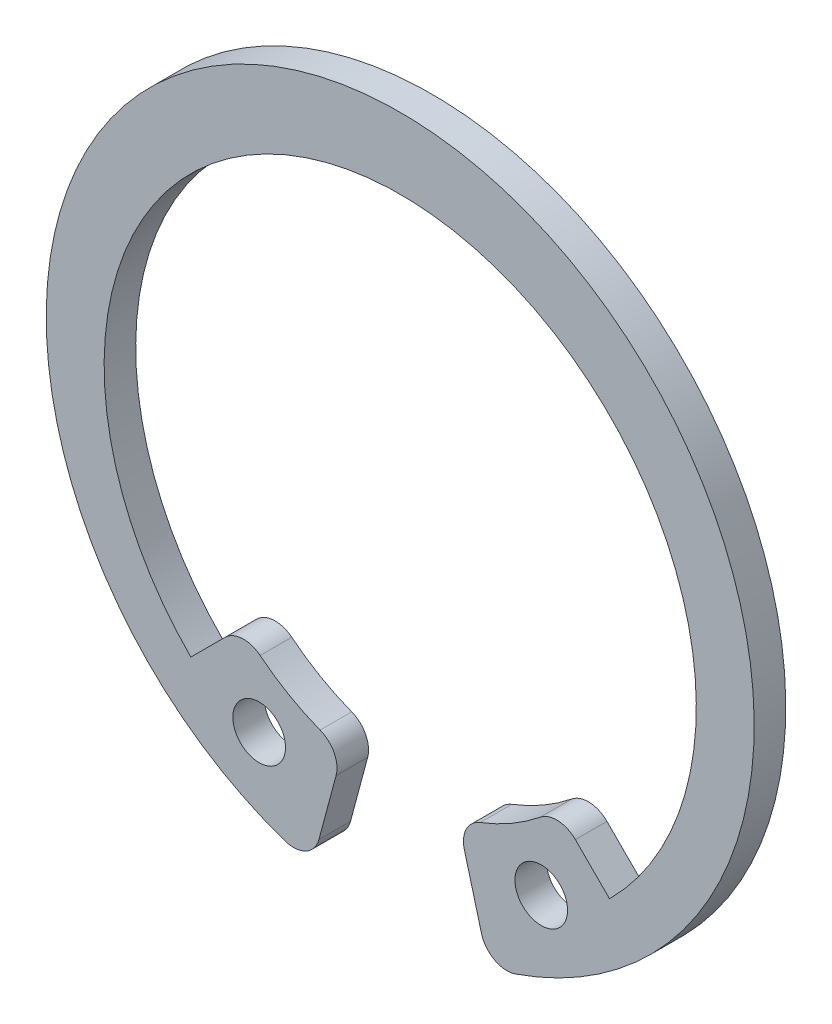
ISO-10303-21;
HEADER;
FILE_DESCRIPTION(('STEP AP214'),'2;1');
FILE_NAME('part.step','',(''),(''),'','','');
FILE_SCHEMA(('AUTOMOTIVE_DESIGN { 1 0 10303 214 1 1 1 1 }'));
ENDSEC;
DATA;
#1=APPLICATION_CONTEXT('core data for automotive mechanical design processes');
#2=APPLICATION_PROTOCOL_DEFINITION('international standard','automotive_design',2000,#1);
#3=PRODUCT_CONTEXT('',#1,'mechanical');
#4=PRODUCT('Part','Part','',(#3));
#5=PRODUCT_RELATED_PRODUCT_CATEGORY('part','',(#4));
#6=PRODUCT_DEFINITION_FORMATION('','',#4);
#7=PRODUCT_DEFINITION_CONTEXT('part definition',#1,'design');
#8=PRODUCT_DEFINITION('design','',#6,#7);
#9=PRODUCT_DEFINITION_SHAPE('','',#8);
#10=(LENGTH_UNIT() NAMED_UNIT(*) SI_UNIT(.MILLI.,.METRE.));
#11=(NAMED_UNIT(*) PLANE_ANGLE_UNIT() SI_UNIT($,.RADIAN.));
#12=(NAMED_UNIT(*) SI_UNIT($,.STERADIAN.) SOLID_ANGLE_UNIT());
#13=UNCERTAINTY_MEASURE_WITH_UNIT(LENGTH_MEASURE(1.E-05),#10,'distance_accuracy_value','');
#14=(GEOMETRIC_REPRESENTATION_CONTEXT(3) GLOBAL_UNCERTAINTY_ASSIGNED_CONTEXT((#13)) GLOBAL_UNIT_ASSIGNED_CONTEXT((#10,
#11,#12)) REPRESENTATION_CONTEXT('',''));
#15=CARTESIAN_POINT('',(0.,0.,0.));
#16=DIRECTION('',(0.,0.,1.));
#17=DIRECTION('',(1.,0.,0.));
#18=AXIS2_PLACEMENT_3D('',#15,#16,#17);
#19=CARTESIAN_POINT('',(5.94920615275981,-7.36341971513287,1.20000000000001));
#20=DIRECTION('',(0.,0.,-1.));
#21=DIRECTION('',(-1.,0.,0.));
#22=AXIS2_PLACEMENT_3D('',#19,#20,#21);
#23=PLANE('',#22);
#24=CARTESIAN_POINT('',(-5.35892287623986,-9.13310690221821,1.20000000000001));
#25=DIRECTION('',(0.,0.,1.));
#26=DIRECTION('',(1.,0.,0.));
#27=AXIS2_PLACEMENT_3D('',#24,#25,#26);
#28=CIRCLE('',#27,1.);
#29=CARTESIAN_POINT('',(-4.35892287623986,-9.13310690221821,1.20000000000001));
#30=VERTEX_POINT('',#29);
#31=EDGE_CURVE('E146',#30,#30,#28,.T.);
#32=ORIENTED_EDGE('',*,*,#31,.F.);
#33=EDGE_LOOP('',(#32));
#34=FACE_BOUND('',#33,.T.);
#35=CARTESIAN_POINT('',(5.94920615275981,-7.36341971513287,1.20000000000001));
#36=DIRECTION('',(0.,0.,1.));
#37=DIRECTION('',(-1.,0.,0.));
#38=AXIS2_PLACEMENT_3D('',#35,#36,#37);
#39=CIRCLE('',#38,1.);
#40=CARTESIAN_POINT('',(6.65631293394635,-6.65631293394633,1.20000000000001));
#41=VERTEX_POINT('',#40);
#42=CARTESIAN_POINT('',(5.32075214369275,-6.585572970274,1.20000000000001));
#43=VERTEX_POINT('',#42);
#44=EDGE_CURVE('E176',#41,#43,#39,.T.);
#45=ORIENTED_EDGE('',*,*,#44,.T.);
#46=CARTESIAN_POINT('',(0.,0.,1.20000000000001));
#47=DIRECTION('',(0.,0.,-1.));
#48=DIRECTION('',(1.,0.,0.));
#49=AXIS2_PLACEMENT_3D('',#46,#47,#48);
#50=CIRCLE('',#49,8.46641451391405);
#51=CARTESIAN_POINT('',(3.04289741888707,-7.90069300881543,1.20000000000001));
#52=VERTEX_POINT('',#51);
#53=EDGE_CURVE('E141',#43,#52,#50,.T.);
#54=ORIENTED_EDGE('',*,*,#53,.T.);
#55=CARTESIAN_POINT('',(3.40230545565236,-8.83387351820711,1.20000000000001));
#56=DIRECTION('',(0.,0.,1.));
#57=DIRECTION('',(-1.,0.,0.));
#58=AXIS2_PLACEMENT_3D('',#55,#56,#57);
#59=CIRCLE('',#58,1.);
#60=CARTESIAN_POINT('',(2.43637962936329,-9.09269256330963,1.20000000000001));
#61=VERTEX_POINT('',#60);
#62=EDGE_CURVE('E179',#52,#61,#59,.T.);
#63=ORIENTED_EDGE('',*,*,#62,.T.);
#64=DIRECTION('',(0.258819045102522,-0.965925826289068,0.));
#65=VECTOR('',#64,1.);
#66=CARTESIAN_POINT('',(3.08940929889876,-11.5298324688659,1.20000000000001));
#67=LINE('',#66,#65);
#68=CARTESIAN_POINT('',(3.08940929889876,-11.5298324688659,1.20000000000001));
#69=VERTEX_POINT('',#68);
#70=EDGE_CURVE('E181',#61,#69,#67,.T.);
#71=ORIENTED_EDGE('',*,*,#70,.T.);
#72=CARTESIAN_POINT('',(4.05533512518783,-11.2710134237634,1.20000000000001));
#73=DIRECTION('',(0.,0.,1.));
#74=DIRECTION('',(-1.,0.,0.));
#75=AXIS2_PLACEMENT_3D('',#72,#73,#74);
#76=CIRCLE('',#75,1.);
#77=CARTESIAN_POINT('',(4.38106485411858,-12.2164763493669,1.20000000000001));
#78=VERTEX_POINT('',#77);
#79=EDGE_CURVE('E183',#69,#78,#76,.T.);
#80=ORIENTED_EDGE('',*,*,#79,.T.);
#81=CARTESIAN_POINT('',(0.,0.5,1.20000000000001));
#82=DIRECTION('',(0.,0.,1.));
#83=DIRECTION('',(1.,0.,0.));
#84=AXIS2_PLACEMENT_3D('',#81,#82,#83);
#85=CIRCLE('',#84,13.45);
#86=CARTESIAN_POINT('',(-4.38106485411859,-12.2164763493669,1.20000000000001));
#87=VERTEX_POINT('',#86);
#88=EDGE_CURVE('E185',#78,#87,#85,.T.);
#89=ORIENTED_EDGE('',*,*,#88,.T.);
#90=CARTESIAN_POINT('',(-4.05533512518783,-11.2710134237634,1.20000000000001));
#91=DIRECTION('',(0.,0.,1.));
#92=DIRECTION('',(1.,0.,0.));
#93=AXIS2_PLACEMENT_3D('',#90,#91,#92);
#94=CIRCLE('',#93,1.);
#95=CARTESIAN_POINT('',(-3.08940929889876,-11.5298324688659,1.20000000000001));
#96=VERTEX_POINT('',#95);
#97=EDGE_CURVE('E187',#87,#96,#94,.T.);
#98=ORIENTED_EDGE('',*,*,#97,.T.);
#99=DIRECTION('',(0.258819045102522,0.965925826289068,0.));
#100=VECTOR('',#99,1.);
#101=CARTESIAN_POINT('',(-3.08940929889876,-11.5298324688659,1.20000000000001));
#102=LINE('',#101,#100);
#103=CARTESIAN_POINT('',(-2.43637962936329,-9.09269256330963,1.20000000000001));
#104=VERTEX_POINT('',#103);
#105=EDGE_CURVE('E189',#96,#104,#102,.T.);
#106=ORIENTED_EDGE('',*,*,#105,.T.);
#107=CARTESIAN_POINT('',(-3.40230545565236,-8.83387351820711,1.20000000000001));
#108=DIRECTION('',(0.,0.,1.));
#109=DIRECTION('',(1.,0.,0.));
#110=AXIS2_PLACEMENT_3D('',#107,#108,#109);
#111=CIRCLE('',#110,1.);
#112=CARTESIAN_POINT('',(-3.04289741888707,-7.90069300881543,1.20000000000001));
#113=VERTEX_POINT('',#112);
#114=EDGE_CURVE('E191',#104,#113,#111,.T.);
#115=ORIENTED_EDGE('',*,*,#114,.T.);
#116=CARTESIAN_POINT('',(0.,0.,1.20000000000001));
#117=DIRECTION('',(0.,0.,-1.));
#118=DIRECTION('',(1.,0.,0.));
#119=AXIS2_PLACEMENT_3D('',#116,#117,#118);
#120=CIRCLE('',#119,8.46641451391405);
#121=CARTESIAN_POINT('',(-5.32075214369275,-6.585572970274,1.20000000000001));
#122=VERTEX_POINT('',#121);
#123=EDGE_CURVE('E193',#113,#122,#120,.T.);
#124=ORIENTED_EDGE('',*,*,#123,.T.);
#125=CARTESIAN_POINT('',(-5.94920615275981,-7.36341971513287,1.20000000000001));
#126=DIRECTION('',(0.,0.,1.));
#127=DIRECTION('',(-1.,0.,0.));
#128=AXIS2_PLACEMENT_3D('',#125,#126,#127);
#129=CIRCLE('',#128,1.);
#130=CARTESIAN_POINT('',(-6.65631293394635,-6.65631293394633,1.20000000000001));
#131=VERTEX_POINT('',#130);
#132=EDGE_CURVE('E195',#122,#131,#129,.T.);
#133=ORIENTED_EDGE('',*,*,#132,.T.);
#134=DIRECTION('',(-0.707106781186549,-0.707106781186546,0.));
#135=VECTOR('',#134,1.);
#136=CARTESIAN_POINT('',(-6.65631293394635,-6.65631293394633,1.20000000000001));
#137=LINE('',#136,#135);
#138=CARTESIAN_POINT('',(-7.95495128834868,-7.95495128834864,1.20000000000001));
#139=VERTEX_POINT('',#138);
#140=EDGE_CURVE('E197',#131,#139,#137,.T.);
#141=ORIENTED_EDGE('',*,*,#140,.T.);
#142=CARTESIAN_POINT('',(0.,0.,1.20000000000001));
#143=DIRECTION('',(0.,0.,-1.));
#144=DIRECTION('',(1.,0.,0.));
#145=AXIS2_PLACEMENT_3D('',#142,#143,#144);
#146=CIRCLE('',#145,11.25);
#147=CARTESIAN_POINT('',(7.95495128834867,-7.95495128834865,1.20000000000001));
#148=VERTEX_POINT('',#147);
#149=EDGE_CURVE('E46',#139,#148,#146,.T.);
#150=ORIENTED_EDGE('',*,*,#149,.T.);
#151=DIRECTION('',(-0.707106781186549,0.707106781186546,0.));
#152=VECTOR('',#151,1.);
#153=CARTESIAN_POINT('',(6.65631293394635,-6.65631293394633,1.20000000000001));
#154=LINE('',#153,#152);
#155=EDGE_CURVE('E41',#148,#41,#154,.T.);
#156=ORIENTED_EDGE('',*,*,#155,.T.);
#157=EDGE_LOOP('',(#45,#54,#63,#71,#80,#89,#98,#106,#115,#124,#133,#141,#150,#156));
#158=FACE_BOUND('',#157,.T.);
#159=CARTESIAN_POINT('',(5.35892287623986,-9.13310690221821,1.20000000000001));
#160=DIRECTION('',(0.,0.,1.));
#161=DIRECTION('',(-1.,0.,0.));
#162=AXIS2_PLACEMENT_3D('',#159,#160,#161);
#163=CIRCLE('',#162,1.);
#164=CARTESIAN_POINT('',(4.35892287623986,-9.13310690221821,1.20000000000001));
#165=VERTEX_POINT('',#164);
#166=EDGE_CURVE('E316',#165,#165,#163,.T.);
#167=ORIENTED_EDGE('',*,*,#166,.F.);
#168=EDGE_LOOP('',(#167));
#169=FACE_BOUND('',#168,.T.);
#170=ADVANCED_FACE('F26',(#34,#158,#169),#23,.F.);
#171=CARTESIAN_POINT('',(5.94920615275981,-7.36341971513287,0.));
#172=DIRECTION('',(0.,0.,-1.));
#173=DIRECTION('',(-1.,0.,0.));
#174=AXIS2_PLACEMENT_3D('',#171,#172,#173);
#175=PLANE('',#174);
#176=CARTESIAN_POINT('',(-5.35892287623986,-9.13310690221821,0.));
#177=DIRECTION('',(0.,0.,1.));
#178=DIRECTION('',(1.,0.,0.));
#179=AXIS2_PLACEMENT_3D('',#176,#177,#178);
#180=CIRCLE('',#179,1.);
#181=CARTESIAN_POINT('',(-4.35892287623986,-9.13310690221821,0.));
#182=VERTEX_POINT('',#181);
#183=EDGE_CURVE('E149',#182,#182,#180,.T.);
#184=ORIENTED_EDGE('',*,*,#183,.T.);
#185=EDGE_LOOP('',(#184));
#186=FACE_BOUND('',#185,.T.);
#187=CARTESIAN_POINT('',(5.94920615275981,-7.36341971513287,0.));
#188=DIRECTION('',(0.,0.,1.));
#189=DIRECTION('',(-1.,0.,0.));
#190=AXIS2_PLACEMENT_3D('',#187,#188,#189);
#191=CIRCLE('',#190,1.);
#192=CARTESIAN_POINT('',(6.65631293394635,-6.65631293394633,0.));
#193=VERTEX_POINT('',#192);
#194=CARTESIAN_POINT('',(5.32075214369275,-6.585572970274,0.));
#195=VERTEX_POINT('',#194);
#196=EDGE_CURVE('E132',#193,#195,#191,.T.);
#197=ORIENTED_EDGE('',*,*,#196,.F.);
#198=DIRECTION('',(-0.707106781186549,0.707106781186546,0.));
#199=VECTOR('',#198,1.);
#200=CARTESIAN_POINT('',(6.65631293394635,-6.65631293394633,0.));
#201=LINE('',#200,#199);
#202=CARTESIAN_POINT('',(7.95495128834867,-7.95495128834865,0.));
#203=VERTEX_POINT('',#202);
#204=EDGE_CURVE('E174',#203,#193,#201,.T.);
#205=ORIENTED_EDGE('',*,*,#204,.F.);
#206=CARTESIAN_POINT('',(0.,0.,0.));
#207=DIRECTION('',(0.,0.,-1.));
#208=DIRECTION('',(1.,0.,0.));
#209=AXIS2_PLACEMENT_3D('',#206,#207,#208);
#210=CIRCLE('',#209,11.25);
#211=CARTESIAN_POINT('',(-7.95495128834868,-7.95495128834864,0.));
#212=VERTEX_POINT('',#211);
#213=EDGE_CURVE('E172',#212,#203,#210,.T.);
#214=ORIENTED_EDGE('',*,*,#213,.F.);
#215=DIRECTION('',(-0.707106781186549,-0.707106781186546,0.));
#216=VECTOR('',#215,1.);
#217=CARTESIAN_POINT('',(-6.65631293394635,-6.65631293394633,0.));
#218=LINE('',#217,#216);
#219=CARTESIAN_POINT('',(-6.65631293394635,-6.65631293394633,0.));
#220=VERTEX_POINT('',#219);
#221=EDGE_CURVE('E170',#220,#212,#218,.T.);
#222=ORIENTED_EDGE('',*,*,#221,.F.);
#223=CARTESIAN_POINT('',(-5.94920615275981,-7.36341971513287,0.));
#224=DIRECTION('',(0.,0.,1.));
#225=DIRECTION('',(-1.,0.,0.));
#226=AXIS2_PLACEMENT_3D('',#223,#224,#225);
#227=CIRCLE('',#226,1.);
#228=CARTESIAN_POINT('',(-5.32075214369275,-6.585572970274,0.));
#229=VERTEX_POINT('',#228);
#230=EDGE_CURVE('E168',#229,#220,#227,.T.);
#231=ORIENTED_EDGE('',*,*,#230,.F.);
#232=CARTESIAN_POINT('',(0.,0.,0.));
#233=DIRECTION('',(0.,0.,-1.));
#234=DIRECTION('',(1.,0.,0.));
#235=AXIS2_PLACEMENT_3D('',#232,#233,#234);
#236=CIRCLE('',#235,8.46641451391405);
#237=CARTESIAN_POINT('',(-3.04289741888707,-7.90069300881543,0.));
#238=VERTEX_POINT('',#237);
#239=EDGE_CURVE('E166',#238,#229,#236,.T.);
#240=ORIENTED_EDGE('',*,*,#239,.F.);
#241=CARTESIAN_POINT('',(-3.40230545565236,-8.83387351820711,0.));
#242=DIRECTION('',(0.,0.,1.));
#243=DIRECTION('',(1.,0.,0.));
#244=AXIS2_PLACEMENT_3D('',#241,#242,#243);
#245=CIRCLE('',#244,1.);
#246=CARTESIAN_POINT('',(-2.43637962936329,-9.09269256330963,0.));
#247=VERTEX_POINT('',#246);
#248=EDGE_CURVE('E164',#247,#238,#245,.T.);
#249=ORIENTED_EDGE('',*,*,#248,.F.);
#250=DIRECTION('',(0.258819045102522,0.965925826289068,0.));
#251=VECTOR('',#250,1.);
#252=CARTESIAN_POINT('',(-3.08940929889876,-11.5298324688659,0.));
#253=LINE('',#252,#251);
#254=CARTESIAN_POINT('',(-3.08940929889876,-11.5298324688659,0.));
#255=VERTEX_POINT('',#254);
#256=EDGE_CURVE('E162',#255,#247,#253,.T.);
#257=ORIENTED_EDGE('',*,*,#256,.F.);
#258=CARTESIAN_POINT('',(-4.05533512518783,-11.2710134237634,0.));
#259=DIRECTION('',(0.,0.,1.));
#260=DIRECTION('',(1.,0.,0.));
#261=AXIS2_PLACEMENT_3D('',#258,#259,#260);
#262=CIRCLE('',#261,1.);
#263=CARTESIAN_POINT('',(-4.38106485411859,-12.2164763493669,0.));
#264=VERTEX_POINT('',#263);
#265=EDGE_CURVE('E160',#264,#255,#262,.T.);
#266=ORIENTED_EDGE('',*,*,#265,.F.);
#267=CARTESIAN_POINT('',(0.,0.5,0.));
#268=DIRECTION('',(0.,0.,1.));
#269=DIRECTION('',(1.,0.,0.));
#270=AXIS2_PLACEMENT_3D('',#267,#268,#269);
#271=CIRCLE('',#270,13.45);
#272=CARTESIAN_POINT('',(4.38106485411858,-12.2164763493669,0.));
#273=VERTEX_POINT('',#272);
#274=EDGE_CURVE('E158',#273,#264,#271,.T.);
#275=ORIENTED_EDGE('',*,*,#274,.F.);
#276=CARTESIAN_POINT('',(4.05533512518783,-11.2710134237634,0.));
#277=DIRECTION('',(0.,0.,1.));
#278=DIRECTION('',(-1.,0.,0.));
#279=AXIS2_PLACEMENT_3D('',#276,#277,#278);
#280=CIRCLE('',#279,1.);
#281=CARTESIAN_POINT('',(3.08940929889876,-11.5298324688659,0.));
#282=VERTEX_POINT('',#281);
#283=EDGE_CURVE('E156',#282,#273,#280,.T.);
#284=ORIENTED_EDGE('',*,*,#283,.F.);
#285=DIRECTION('',(0.258819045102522,-0.965925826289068,0.));
#286=VECTOR('',#285,1.);
#287=CARTESIAN_POINT('',(3.08940929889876,-11.5298324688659,0.));
#288=LINE('',#287,#286);
#289=CARTESIAN_POINT('',(2.43637962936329,-9.09269256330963,0.));
#290=VERTEX_POINT('',#289);
#291=EDGE_CURVE('E154',#290,#282,#288,.T.);
#292=ORIENTED_EDGE('',*,*,#291,.F.);
#293=CARTESIAN_POINT('',(3.40230545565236,-8.83387351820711,0.));
#294=DIRECTION('',(0.,0.,1.));
#295=DIRECTION('',(-1.,0.,0.));
#296=AXIS2_PLACEMENT_3D('',#293,#294,#295);
#297=CIRCLE('',#296,1.);
#298=CARTESIAN_POINT('',(3.04289741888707,-7.90069300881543,0.));
#299=VERTEX_POINT('',#298);
#300=EDGE_CURVE('E134',#299,#290,#297,.T.);
#301=ORIENTED_EDGE('',*,*,#300,.F.);
#302=CARTESIAN_POINT('',(0.,0.,0.));
#303=DIRECTION('',(0.,0.,-1.));
#304=DIRECTION('',(1.,0.,0.));
#305=AXIS2_PLACEMENT_3D('',#302,#303,#304);
#306=CIRCLE('',#305,8.46641451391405);
#307=EDGE_CURVE('E127',#195,#299,#306,.T.);
#308=ORIENTED_EDGE('',*,*,#307,.F.);
#309=EDGE_LOOP('',(#197,#205,#214,#222,#231,#240,#249,#257,#266,#275,#284,#292,#301,#308));
#310=FACE_BOUND('',#309,.T.);
#311=CARTESIAN_POINT('',(5.35892287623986,-9.13310690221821,0.));
#312=DIRECTION('',(0.,0.,1.));
#313=DIRECTION('',(-1.,0.,0.));
#314=AXIS2_PLACEMENT_3D('',#311,#312,#313);
#315=CIRCLE('',#314,1.);
#316=CARTESIAN_POINT('',(4.35892287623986,-9.13310690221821,0.));
#317=VERTEX_POINT('',#316);
#318=EDGE_CURVE('E319',#317,#317,#315,.T.);
#319=ORIENTED_EDGE('',*,*,#318,.T.);
#320=EDGE_LOOP('',(#319));
#321=FACE_BOUND('',#320,.T.);
#322=ADVANCED_FACE('F128',(#186,#310,#321),#175,.T.);
#323=CARTESIAN_POINT('',(5.94920615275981,-7.36341971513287,1.20000000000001));
#324=DIRECTION('',(0.,0.,-1.));
#325=DIRECTION('',(-1.,0.,0.));
#326=AXIS2_PLACEMENT_3D('',#323,#324,#325);
#327=CYLINDRICAL_SURFACE('',#326,1.);
#328=ORIENTED_EDGE('',*,*,#196,.T.);
#329=DIRECTION('',(0.,0.,-1.));
#330=VECTOR('',#329,1.);
#331=CARTESIAN_POINT('',(5.32075214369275,-6.585572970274,1.20000000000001));
#332=LINE('',#331,#330);
#333=EDGE_CURVE('E11',#43,#195,#332,.T.);
#334=ORIENTED_EDGE('',*,*,#333,.F.);
#335=ORIENTED_EDGE('',*,*,#44,.F.);
#336=DIRECTION('',(0.,0.,-1.));
#337=VECTOR('',#336,1.);
#338=CARTESIAN_POINT('',(6.65631293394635,-6.65631293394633,1.20000000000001));
#339=LINE('',#338,#337);
#340=EDGE_CURVE('E145',#41,#193,#339,.T.);
#341=ORIENTED_EDGE('',*,*,#340,.T.);
#342=EDGE_LOOP('',(#328,#334,#335,#341));
#343=FACE_BOUND('',#342,.T.);
#344=ADVANCED_FACE('F28',(#343),#327,.T.);
#345=CARTESIAN_POINT('',(0.,0.,1.20000000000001));
#346=DIRECTION('',(0.,0.,-1.));
#347=DIRECTION('',(-1.,0.,0.));
#348=AXIS2_PLACEMENT_3D('',#345,#346,#347);
#349=CYLINDRICAL_SURFACE('',#348,8.46641451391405);
#350=ORIENTED_EDGE('',*,*,#307,.T.);
#351=DIRECTION('',(0.,0.,-1.));
#352=VECTOR('',#351,1.);
#353=CARTESIAN_POINT('',(3.04289741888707,-7.90069300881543,1.20000000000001));
#354=LINE('',#353,#352);
#355=EDGE_CURVE('E34',#52,#299,#354,.T.);
#356=ORIENTED_EDGE('',*,*,#355,.F.);
#357=ORIENTED_EDGE('',*,*,#53,.F.);
#358=ORIENTED_EDGE('',*,*,#333,.T.);
#359=EDGE_LOOP('',(#350,#356,#357,#358));
#360=FACE_BOUND('',#359,.T.);
#361=ADVANCED_FACE('F140',(#360),#349,.F.);
#362=CARTESIAN_POINT('',(3.40230545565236,-8.83387351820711,1.20000000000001));
#363=DIRECTION('',(0.,0.,-1.));
#364=DIRECTION('',(-1.,0.,0.));
#365=AXIS2_PLACEMENT_3D('',#362,#363,#364);
#366=CYLINDRICAL_SURFACE('',#365,1.);
#367=ORIENTED_EDGE('',*,*,#300,.T.);
#368=DIRECTION('',(0.,0.,-1.));
#369=VECTOR('',#368,1.);
#370=CARTESIAN_POINT('',(2.43637962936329,-9.09269256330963,1.20000000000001));
#371=LINE('',#370,#369);
#372=EDGE_CURVE('E232',#61,#290,#371,.T.);
#373=ORIENTED_EDGE('',*,*,#372,.F.);
#374=ORIENTED_EDGE('',*,*,#62,.F.);
#375=ORIENTED_EDGE('',*,*,#355,.T.);
#376=EDGE_LOOP('',(#367,#373,#374,#375));
#377=FACE_BOUND('',#376,.T.);
#378=ADVANCED_FACE('F236',(#377),#366,.T.);
#379=CARTESIAN_POINT('',(3.08940929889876,-11.5298324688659,1.20000000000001));
#380=DIRECTION('',(0.965925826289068,0.258819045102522,0.));
#381=DIRECTION('',(-0.258819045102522,0.965925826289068,0.));
#382=AXIS2_PLACEMENT_3D('',#379,#380,#381);
#383=PLANE('',#382);
#384=ORIENTED_EDGE('',*,*,#291,.T.);
#385=DIRECTION('',(0.,0.,-1.));
#386=VECTOR('',#385,1.);
#387=CARTESIAN_POINT('',(3.08940929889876,-11.5298324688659,1.20000000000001));
#388=LINE('',#387,#386);
#389=EDGE_CURVE('E229',#69,#282,#388,.T.);
#390=ORIENTED_EDGE('',*,*,#389,.F.);
#391=ORIENTED_EDGE('',*,*,#70,.F.);
#392=ORIENTED_EDGE('',*,*,#372,.T.);
#393=EDGE_LOOP('',(#384,#390,#391,#392));
#394=FACE_BOUND('',#393,.T.);
#395=ADVANCED_FACE('F244',(#394),#383,.F.);
#396=CARTESIAN_POINT('',(4.05533512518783,-11.2710134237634,1.20000000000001));
#397=DIRECTION('',(0.,0.,-1.));
#398=DIRECTION('',(-1.,0.,0.));
#399=AXIS2_PLACEMENT_3D('',#396,#397,#398);
#400=CYLINDRICAL_SURFACE('',#399,1.);
#401=ORIENTED_EDGE('',*,*,#283,.T.);
#402=DIRECTION('',(0.,0.,-1.));
#403=VECTOR('',#402,1.);
#404=CARTESIAN_POINT('',(4.38106485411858,-12.2164763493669,1.20000000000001));
#405=LINE('',#404,#403);
#406=EDGE_CURVE('E226',#78,#273,#405,.T.);
#407=ORIENTED_EDGE('',*,*,#406,.F.);
#408=ORIENTED_EDGE('',*,*,#79,.F.);
#409=ORIENTED_EDGE('',*,*,#389,.T.);
#410=EDGE_LOOP('',(#401,#407,#408,#409));
#411=FACE_BOUND('',#410,.T.);
#412=ADVANCED_FACE('F247',(#411),#400,.T.);
#413=CARTESIAN_POINT('',(0.,0.5,1.20000000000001));
#414=DIRECTION('',(0.,0.,-1.));
#415=DIRECTION('',(-1.,0.,0.));
#416=AXIS2_PLACEMENT_3D('',#413,#414,#415);
#417=CYLINDRICAL_SURFACE('',#416,13.45);
#418=ORIENTED_EDGE('',*,*,#274,.T.);
#419=DIRECTION('',(0.,0.,-1.));
#420=VECTOR('',#419,1.);
#421=CARTESIAN_POINT('',(-4.38106485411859,-12.2164763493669,1.20000000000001));
#422=LINE('',#421,#420);
#423=EDGE_CURVE('E223',#87,#264,#422,.T.);
#424=ORIENTED_EDGE('',*,*,#423,.F.);
#425=ORIENTED_EDGE('',*,*,#88,.F.);
#426=ORIENTED_EDGE('',*,*,#406,.T.);
#427=EDGE_LOOP('',(#418,#424,#425,#426));
#428=FACE_BOUND('',#427,.T.);
#429=ADVANCED_FACE('F252',(#428),#417,.T.);
#430=CARTESIAN_POINT('',(-4.05533512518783,-11.2710134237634,1.20000000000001));
#431=DIRECTION('',(0.,0.,-1.));
#432=DIRECTION('',(-1.,0.,0.));
#433=AXIS2_PLACEMENT_3D('',#430,#431,#432);
#434=CYLINDRICAL_SURFACE('',#433,1.);
#435=ORIENTED_EDGE('',*,*,#265,.T.);
#436=DIRECTION('',(0.,0.,-1.));
#437=VECTOR('',#436,1.);
#438=CARTESIAN_POINT('',(-3.08940929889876,-11.5298324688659,1.20000000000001));
#439=LINE('',#438,#437);
#440=EDGE_CURVE('E220',#96,#255,#439,.T.);
#441=ORIENTED_EDGE('',*,*,#440,.F.);
#442=ORIENTED_EDGE('',*,*,#97,.F.);
#443=ORIENTED_EDGE('',*,*,#423,.T.);
#444=EDGE_LOOP('',(#435,#441,#442,#443));
#445=FACE_BOUND('',#444,.T.);
#446=ADVANCED_FACE('F258',(#445),#434,.T.);
#447=CARTESIAN_POINT('',(-3.08940929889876,-11.5298324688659,1.20000000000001));
#448=DIRECTION('',(-0.965925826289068,0.258819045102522,0.));
#449=DIRECTION('',(-0.258819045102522,-0.965925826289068,0.));
#450=AXIS2_PLACEMENT_3D('',#447,#448,#449);
#451=PLANE('',#450);
#452=ORIENTED_EDGE('',*,*,#256,.T.);
#453=DIRECTION('',(0.,0.,-1.));
#454=VECTOR('',#453,1.);
#455=CARTESIAN_POINT('',(-2.43637962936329,-9.09269256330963,1.20000000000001));
#456=LINE('',#455,#454);
#457=EDGE_CURVE('E217',#104,#247,#456,.T.);
#458=ORIENTED_EDGE('',*,*,#457,.F.);
#459=ORIENTED_EDGE('',*,*,#105,.F.);
#460=ORIENTED_EDGE('',*,*,#440,.T.);
#461=EDGE_LOOP('',(#452,#458,#459,#460));
#462=FACE_BOUND('',#461,.T.);
#463=ADVANCED_FACE('F262',(#462),#451,.F.);
#464=CARTESIAN_POINT('',(-3.40230545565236,-8.83387351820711,1.20000000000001));
#465=DIRECTION('',(0.,0.,-1.));
#466=DIRECTION('',(-1.,0.,0.));
#467=AXIS2_PLACEMENT_3D('',#464,#465,#466);
#468=CYLINDRICAL_SURFACE('',#467,1.);
#469=ORIENTED_EDGE('',*,*,#248,.T.);
#470=DIRECTION('',(0.,0.,-1.));
#471=VECTOR('',#470,1.);
#472=CARTESIAN_POINT('',(-3.04289741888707,-7.90069300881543,1.20000000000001));
#473=LINE('',#472,#471);
#474=EDGE_CURVE('E214',#113,#238,#473,.T.);
#475=ORIENTED_EDGE('',*,*,#474,.F.);
#476=ORIENTED_EDGE('',*,*,#114,.F.);
#477=ORIENTED_EDGE('',*,*,#457,.T.);
#478=EDGE_LOOP('',(#469,#475,#476,#477));
#479=FACE_BOUND('',#478,.T.);
#480=ADVANCED_FACE('F267',(#479),#468,.T.);
#481=CARTESIAN_POINT('',(0.,0.,1.20000000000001));
#482=DIRECTION('',(0.,0.,-1.));
#483=DIRECTION('',(-1.,0.,0.));
#484=AXIS2_PLACEMENT_3D('',#481,#482,#483);
#485=CYLINDRICAL_SURFACE('',#484,8.46641451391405);
#486=ORIENTED_EDGE('',*,*,#239,.T.);
#487=DIRECTION('',(0.,0.,-1.));
#488=VECTOR('',#487,1.);
#489=CARTESIAN_POINT('',(-5.32075214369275,-6.585572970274,1.20000000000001));
#490=LINE('',#489,#488);
#491=EDGE_CURVE('E211',#122,#229,#490,.T.);
#492=ORIENTED_EDGE('',*,*,#491,.F.);
#493=ORIENTED_EDGE('',*,*,#123,.F.);
#494=ORIENTED_EDGE('',*,*,#474,.T.);
#495=EDGE_LOOP('',(#486,#492,#493,#494));
#496=FACE_BOUND('',#495,.T.);
#497=ADVANCED_FACE('F273',(#496),#485,.F.);
#498=CARTESIAN_POINT('',(-5.94920615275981,-7.36341971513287,1.20000000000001));
#499=DIRECTION('',(0.,0.,-1.));
#500=DIRECTION('',(-1.,0.,0.));
#501=AXIS2_PLACEMENT_3D('',#498,#499,#500);
#502=CYLINDRICAL_SURFACE('',#501,1.);
#503=ORIENTED_EDGE('',*,*,#230,.T.);
#504=DIRECTION('',(0.,0.,-1.));
#505=VECTOR('',#504,1.);
#506=CARTESIAN_POINT('',(-6.65631293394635,-6.65631293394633,1.20000000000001));
#507=LINE('',#506,#505);
#508=EDGE_CURVE('E208',#131,#220,#507,.T.);
#509=ORIENTED_EDGE('',*,*,#508,.F.);
#510=ORIENTED_EDGE('',*,*,#132,.F.);
#511=ORIENTED_EDGE('',*,*,#491,.T.);
#512=EDGE_LOOP('',(#503,#509,#510,#511));
#513=FACE_BOUND('',#512,.T.);
#514=ADVANCED_FACE('F277',(#513),#502,.T.);
#515=CARTESIAN_POINT('',(-6.65631293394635,-6.65631293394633,1.20000000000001));
#516=DIRECTION('',(0.707106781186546,-0.70710678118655,0.));
#517=DIRECTION('',(0.70710678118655,0.707106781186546,0.));
#518=AXIS2_PLACEMENT_3D('',#515,#516,#517);
#519=PLANE('',#518);
#520=ORIENTED_EDGE('',*,*,#221,.T.);
#521=DIRECTION('',(0.,0.,-1.));
#522=VECTOR('',#521,1.);
#523=CARTESIAN_POINT('',(-7.95495128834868,-7.95495128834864,1.20000000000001));
#524=LINE('',#523,#522);
#525=EDGE_CURVE('E205',#139,#212,#524,.T.);
#526=ORIENTED_EDGE('',*,*,#525,.F.);
#527=ORIENTED_EDGE('',*,*,#140,.F.);
#528=ORIENTED_EDGE('',*,*,#508,.T.);
#529=EDGE_LOOP('',(#520,#526,#527,#528));
#530=FACE_BOUND('',#529,.T.);
#531=ADVANCED_FACE('F282',(#530),#519,.F.);
#532=CARTESIAN_POINT('',(0.,0.,1.20000000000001));
#533=DIRECTION('',(0.,0.,-1.));
#534=DIRECTION('',(-1.,0.,0.));
#535=AXIS2_PLACEMENT_3D('',#532,#533,#534);
#536=CYLINDRICAL_SURFACE('',#535,11.25);
#537=ORIENTED_EDGE('',*,*,#213,.T.);
#538=DIRECTION('',(0.,0.,-1.));
#539=VECTOR('',#538,1.);
#540=CARTESIAN_POINT('',(7.95495128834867,-7.95495128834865,1.20000000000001));
#541=LINE('',#540,#539);
#542=EDGE_CURVE('E202',#148,#203,#541,.T.);
#543=ORIENTED_EDGE('',*,*,#542,.F.);
#544=ORIENTED_EDGE('',*,*,#149,.F.);
#545=ORIENTED_EDGE('',*,*,#525,.T.);
#546=EDGE_LOOP('',(#537,#543,#544,#545));
#547=FACE_BOUND('',#546,.T.);
#548=ADVANCED_FACE('F285',(#547),#536,.F.);
#549=CARTESIAN_POINT('',(6.65631293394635,-6.65631293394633,1.20000000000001));
#550=DIRECTION('',(-0.707106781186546,-0.70710678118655,0.));
#551=DIRECTION('',(0.70710678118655,-0.707106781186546,0.));
#552=AXIS2_PLACEMENT_3D('',#549,#550,#551);
#553=PLANE('',#552);
#554=ORIENTED_EDGE('',*,*,#204,.T.);
#555=ORIENTED_EDGE('',*,*,#340,.F.);
#556=ORIENTED_EDGE('',*,*,#155,.F.);
#557=ORIENTED_EDGE('',*,*,#542,.T.);
#558=EDGE_LOOP('',(#554,#555,#556,#557));
#559=FACE_BOUND('',#558,.T.);
#560=ADVANCED_FACE('F287',(#559),#553,.F.);
#561=CARTESIAN_POINT('',(-5.35892287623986,-9.13310690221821,1.20000000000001));
#562=DIRECTION('',(0.,0.,-1.));
#563=DIRECTION('',(-1.,0.,0.));
#564=AXIS2_PLACEMENT_3D('',#561,#562,#563);
#565=CYLINDRICAL_SURFACE('',#564,1.);
#566=ORIENTED_EDGE('',*,*,#31,.T.);
#567=EDGE_LOOP('',(#566));
#568=FACE_BOUND('',#567,.T.);
#569=ORIENTED_EDGE('',*,*,#183,.F.);
#570=EDGE_LOOP('',(#569));
#571=FACE_BOUND('',#570,.T.);
#572=ADVANCED_FACE('F289',(#568,#571),#565,.F.);
#573=CARTESIAN_POINT('',(5.35892287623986,-9.13310690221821,1.20000000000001));
#574=DIRECTION('',(0.,0.,-1.));
#575=DIRECTION('',(-1.,0.,0.));
#576=AXIS2_PLACEMENT_3D('',#573,#574,#575);
#577=CYLINDRICAL_SURFACE('',#576,1.);
#578=ORIENTED_EDGE('',*,*,#166,.T.);
#579=EDGE_LOOP('',(#578));
#580=FACE_BOUND('',#579,.T.);
#581=ORIENTED_EDGE('',*,*,#318,.F.);
#582=EDGE_LOOP('',(#581));
#583=FACE_BOUND('',#582,.T.);
#584=ADVANCED_FACE('F295',(#580,#583),#577,.F.);
#585=CLOSED_SHELL('',(#170,#322,#344,#361,#378,#395,#412,#429,#446,#463,#480,#497,#514,#531,
#548,#560,#572,#584));
#586=MANIFOLD_SOLID_BREP('B2',#585);
#587=ADVANCED_BREP_SHAPE_REPRESENTATION('',(#18,#586),#14);
#588=SHAPE_DEFINITION_REPRESENTATION(#9,#587);
ENDSEC;
END-ISO-10303-21;
